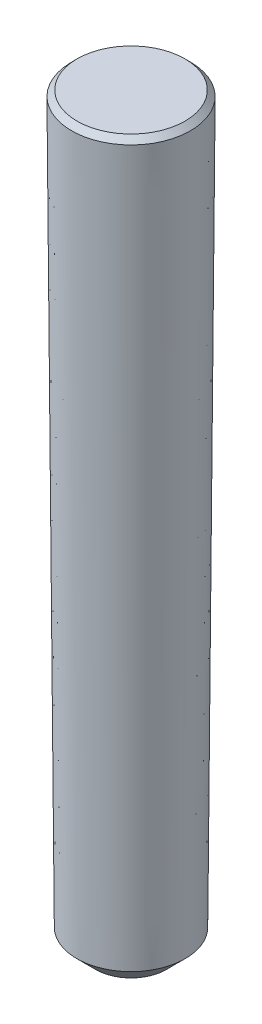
from build123d import *

# Parameters (mm, degrees)
CHAMFER_1_SIZE  = 0.5
CHAMFER_1_SIZE2 = 0.50366471
CHAMFER_2_SIZE  = 0.15
CHAMFER_2_SIZE2 = 0.148924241


with BuildPart() as part:
    # Sketch 2 → Revolve 1 (revolve)
    with BuildSketch(Plane.XY, mode=Mode.PRIVATE) as revolve_1_sk:
        Polygon((0, 0), (0, -20), (-1.455, -20), (-1.6, 0), align=None)
    revolve(revolve_1_sk.sketch.rotate(Axis((0, 30.829635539, 0), (0, -1, 0)), 270), axis=Axis((0, 30.829635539, 0), (0, -1, 0)))

    # Chamfer 1
    chamfer_1_edges = [part.edges().sort_by_distance(p)[0] for p in [
        (0, -20, -1.455),
    ]]
    chamfer_1_side = [part.faces().sort_by_distance(p)[0] for p in [
        (0, -20, 0),
    ]]
    chamfer(chamfer_1_edges, length=CHAMFER_1_SIZE, length2=CHAMFER_1_SIZE2, reference=chamfer_1_side[0])

    # Chamfer 2
    chamfer_2_edges = [part.edges().sort_by_distance(p)[0] for p in [
        (0, 0, -1.6),
    ]]
    chamfer_2_side = [part.faces().sort_by_distance(p)[0] for p in [
        (0, -9.748174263, -1.529325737),
    ]]
    chamfer(chamfer_2_edges, length=CHAMFER_2_SIZE, length2=CHAMFER_2_SIZE2, reference=chamfer_2_side[0])


solid = part.part
